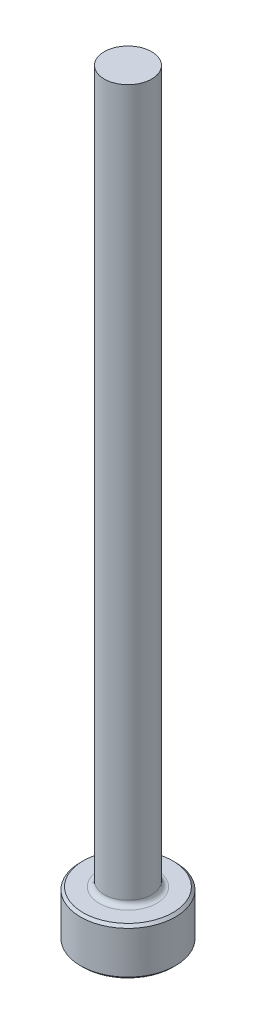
ISO-10303-21;
HEADER;
FILE_DESCRIPTION(('STEP AP214'),'2;1');
FILE_NAME('part.step','',(''),(''),'','','');
FILE_SCHEMA(('AUTOMOTIVE_DESIGN { 1 0 10303 214 1 1 1 1 }'));
ENDSEC;
DATA;
#1=APPLICATION_CONTEXT('core data for automotive mechanical design processes');
#2=APPLICATION_PROTOCOL_DEFINITION('international standard','automotive_design',2000,#1);
#3=PRODUCT_CONTEXT('',#1,'mechanical');
#4=PRODUCT('Part','Part','',(#3));
#5=PRODUCT_RELATED_PRODUCT_CATEGORY('part','',(#4));
#6=PRODUCT_DEFINITION_FORMATION('','',#4);
#7=PRODUCT_DEFINITION_CONTEXT('part definition',#1,'design');
#8=PRODUCT_DEFINITION('design','',#6,#7);
#9=PRODUCT_DEFINITION_SHAPE('','',#8);
#10=(LENGTH_UNIT() NAMED_UNIT(*) SI_UNIT(.MILLI.,.METRE.));
#11=(NAMED_UNIT(*) PLANE_ANGLE_UNIT() SI_UNIT($,.RADIAN.));
#12=(NAMED_UNIT(*) SI_UNIT($,.STERADIAN.) SOLID_ANGLE_UNIT());
#13=UNCERTAINTY_MEASURE_WITH_UNIT(LENGTH_MEASURE(1.E-05),#10,'distance_accuracy_value','');
#14=(GEOMETRIC_REPRESENTATION_CONTEXT(3) GLOBAL_UNCERTAINTY_ASSIGNED_CONTEXT((#13)) GLOBAL_UNIT_ASSIGNED_CONTEXT((#10,
#11,#12)) REPRESENTATION_CONTEXT('',''));
#15=CARTESIAN_POINT('',(0.,0.,0.));
#16=DIRECTION('',(0.,0.,1.));
#17=DIRECTION('',(1.,0.,0.));
#18=AXIS2_PLACEMENT_3D('',#15,#16,#17);
#19=CARTESIAN_POINT('',(0.,0.,0.));
#20=DIRECTION('',(0.,-1.,0.));
#21=DIRECTION('',(0.,0.,-1.));
#22=AXIS2_PLACEMENT_3D('',#19,#20,#21);
#23=PLANE('',#22);
#24=CARTESIAN_POINT('',(0.,0.,0.));
#25=DIRECTION('',(0.,-1.,0.));
#26=DIRECTION('',(0.,0.,-1.));
#27=AXIS2_PLACEMENT_3D('',#24,#25,#26);
#28=CIRCLE('',#27,4.50849999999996);
#29=CARTESIAN_POINT('',(0.,0.,-4.50849999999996));
#30=VERTEX_POINT('',#29);
#31=EDGE_CURVE('E46',#30,#30,#28,.T.);
#32=ORIENTED_EDGE('',*,*,#31,.T.);
#33=EDGE_LOOP('',(#32));
#34=FACE_BOUND('',#33,.T.);
#35=ADVANCED_FACE('F35',(#34),#23,.T.);
#36=CARTESIAN_POINT('',(0.,259.958771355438,0.));
#37=DIRECTION('',(0.,1.,0.));
#38=DIRECTION('',(0.,0.,1.));
#39=AXIS2_PLACEMENT_3D('',#36,#37,#38);
#40=CYLINDRICAL_SURFACE('',#39,4.76249999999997);
#41=CARTESIAN_POINT('',(0.,4.49580000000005,0.));
#42=DIRECTION('',(0.,1.,0.));
#43=DIRECTION('',(0.,0.,1.));
#44=AXIS2_PLACEMENT_3D('',#41,#42,#43);
#45=CIRCLE('',#44,4.76249999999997);
#46=CARTESIAN_POINT('',(0.,4.49580000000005,4.76249999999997));
#47=VERTEX_POINT('',#46);
#48=EDGE_CURVE('E50',#47,#47,#45,.F.);
#49=ORIENTED_EDGE('',*,*,#48,.T.);
#50=EDGE_LOOP('',(#49));
#51=FACE_BOUND('',#50,.T.);
#52=CARTESIAN_POINT('',(0.,0.254000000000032,0.));
#53=DIRECTION('',(0.,-1.,0.));
#54=DIRECTION('',(0.,0.,-1.));
#55=AXIS2_PLACEMENT_3D('',#52,#53,#54);
#56=CIRCLE('',#55,4.76249999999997);
#57=CARTESIAN_POINT('',(0.,0.254000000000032,-4.76249999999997));
#58=VERTEX_POINT('',#57);
#59=EDGE_CURVE('E55',#58,#58,#56,.F.);
#60=ORIENTED_EDGE('',*,*,#59,.T.);
#61=EDGE_LOOP('',(#60));
#62=FACE_BOUND('',#61,.T.);
#63=ADVANCED_FACE('F77',(#51,#62),#40,.T.);
#64=CARTESIAN_POINT('',(-4.76249999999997,4.7498,0.));
#65=DIRECTION('',(0.,1.,0.));
#66=DIRECTION('',(0.,0.,1.));
#67=AXIS2_PLACEMENT_3D('',#64,#65,#66);
#68=PLANE('',#67);
#69=CARTESIAN_POINT('',(0.,4.7498,0.));
#70=DIRECTION('',(0.,1.,0.));
#71=DIRECTION('',(0.,0.,1.));
#72=AXIS2_PLACEMENT_3D('',#69,#70,#71);
#73=CIRCLE('',#72,2.88924999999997);
#74=CARTESIAN_POINT('',(0.,4.7498,2.88924999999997));
#75=VERTEX_POINT('',#74);
#76=EDGE_CURVE('E10',#75,#75,#73,.F.);
#77=ORIENTED_EDGE('',*,*,#76,.T.);
#78=EDGE_LOOP('',(#77));
#79=FACE_BOUND('',#78,.T.);
#80=CARTESIAN_POINT('',(0.,4.7498,0.));
#81=DIRECTION('',(0.,1.,0.));
#82=DIRECTION('',(0.,0.,1.));
#83=AXIS2_PLACEMENT_3D('',#80,#81,#82);
#84=CIRCLE('',#83,4.50850000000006);
#85=CARTESIAN_POINT('',(0.,4.7498,4.50850000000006));
#86=VERTEX_POINT('',#85);
#87=EDGE_CURVE('E58',#86,#86,#84,.T.);
#88=ORIENTED_EDGE('',*,*,#87,.T.);
#89=EDGE_LOOP('',(#88));
#90=FACE_BOUND('',#89,.T.);
#91=ADVANCED_FACE('F69',(#79,#90),#68,.T.);
#92=CARTESIAN_POINT('',(0.,259.958771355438,0.));
#93=DIRECTION('',(0.,1.,0.));
#94=DIRECTION('',(0.,0.,1.));
#95=AXIS2_PLACEMENT_3D('',#92,#93,#94);
#96=CYLINDRICAL_SURFACE('',#95,2.38124999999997);
#97=CARTESIAN_POINT('',(0.,5.25779999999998,0.));
#98=DIRECTION('',(0.,1.,0.));
#99=DIRECTION('',(0.,0.,1.));
#100=AXIS2_PLACEMENT_3D('',#97,#98,#99);
#101=CIRCLE('',#100,2.38124999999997);
#102=CARTESIAN_POINT('',(0.,5.25779999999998,2.38124999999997));
#103=VERTEX_POINT('',#102);
#104=EDGE_CURVE('E42',#103,#103,#101,.T.);
#105=ORIENTED_EDGE('',*,*,#104,.T.);
#106=EDGE_LOOP('',(#105));
#107=FACE_BOUND('',#106,.T.);
#108=CARTESIAN_POINT('',(0.,76.2,0.));
#109=DIRECTION('',(0.,1.,0.));
#110=DIRECTION('',(0.,0.,1.));
#111=AXIS2_PLACEMENT_3D('',#108,#109,#110);
#112=CIRCLE('',#111,2.38124999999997);
#113=CARTESIAN_POINT('',(0.,76.2,2.38124999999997));
#114=VERTEX_POINT('',#113);
#115=EDGE_CURVE('E61',#114,#114,#112,.T.);
#116=ORIENTED_EDGE('',*,*,#115,.F.);
#117=EDGE_LOOP('',(#116));
#118=FACE_BOUND('',#117,.T.);
#119=ADVANCED_FACE('F67',(#107,#118),#96,.T.);
#120=CARTESIAN_POINT('',(-2.38124999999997,76.2,0.));
#121=DIRECTION('',(0.,1.,0.));
#122=DIRECTION('',(0.,0.,1.));
#123=AXIS2_PLACEMENT_3D('',#120,#121,#122);
#124=PLANE('',#123);
#125=ORIENTED_EDGE('',*,*,#115,.T.);
#126=EDGE_LOOP('',(#125));
#127=FACE_BOUND('',#126,.T.);
#128=ADVANCED_FACE('F65',(#127),#124,.T.);
#129=CARTESIAN_POINT('',(0.,4.74980000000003,0.));
#130=DIRECTION('',(0.,-1.,0.));
#131=DIRECTION('',(0.,0.,-1.));
#132=AXIS2_PLACEMENT_3D('',#129,#130,#131);
#133=CONICAL_SURFACE('',#132,4.50850000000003,0.785398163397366);
#134=ORIENTED_EDGE('',*,*,#48,.F.);
#135=EDGE_LOOP('',(#134));
#136=FACE_BOUND('',#135,.T.);
#137=ORIENTED_EDGE('',*,*,#87,.F.);
#138=EDGE_LOOP('',(#137));
#139=FACE_BOUND('',#138,.T.);
#140=ADVANCED_FACE('F75',(#136,#139),#133,.T.);
#141=CARTESIAN_POINT('',(0.,0.254000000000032,0.));
#142=DIRECTION('',(0.,1.,0.));
#143=DIRECTION('',(0.,0.,1.));
#144=AXIS2_PLACEMENT_3D('',#141,#142,#143);
#145=CONICAL_SURFACE('',#144,4.76249999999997,0.785398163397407);
#146=ORIENTED_EDGE('',*,*,#31,.F.);
#147=EDGE_LOOP('',(#146));
#148=FACE_BOUND('',#147,.T.);
#149=ORIENTED_EDGE('',*,*,#59,.F.);
#150=EDGE_LOOP('',(#149));
#151=FACE_BOUND('',#150,.T.);
#152=ADVANCED_FACE('F89',(#148,#151),#145,.T.);
#153=CARTESIAN_POINT('',(0.,5.25779999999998,0.));
#154=DIRECTION('',(0.,1.,0.));
#155=DIRECTION('',(0.,0.,1.));
#156=AXIS2_PLACEMENT_3D('',#153,#154,#155);
#157=TOROIDAL_SURFACE('',#156,2.88924999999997,0.508);
#158=ORIENTED_EDGE('',*,*,#76,.F.);
#159=EDGE_LOOP('',(#158));
#160=FACE_BOUND('',#159,.T.);
#161=ORIENTED_EDGE('',*,*,#104,.F.);
#162=EDGE_LOOP('',(#161));
#163=FACE_BOUND('',#162,.T.);
#164=ADVANCED_FACE('F37',(#160,#163),#157,.F.);
#165=CLOSED_SHELL('',(#35,#63,#91,#119,#128,#140,#152,#164));
#166=MANIFOLD_SOLID_BREP('B2',#165);
#167=ADVANCED_BREP_SHAPE_REPRESENTATION('',(#18,#166),#14);
#168=SHAPE_DEFINITION_REPRESENTATION(#9,#167);
ENDSEC;
END-ISO-10303-21;
